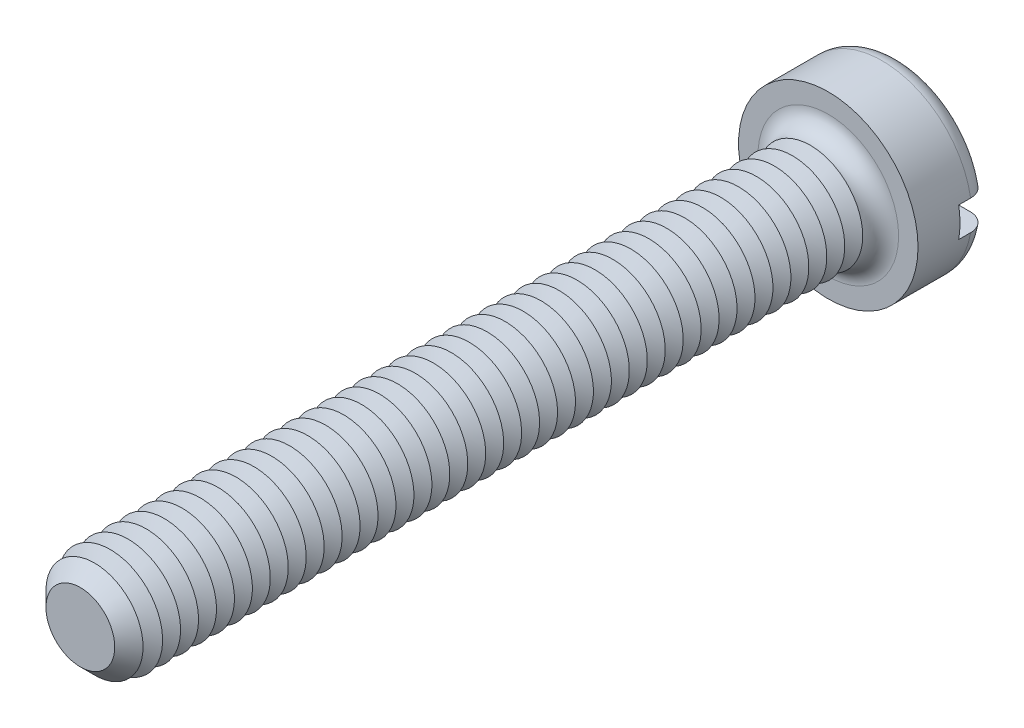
from build123d import *

# Parameters (mm, degrees)
SKETCH3_R           = 3
BOSS_EXTRUDE2_DEPTH = 2.4
SKETCH4_R           = 1.75
BOSS_EXTRUDE3_DEPTH = 25
FILLET1_R           = 0.6
CHAMFER1_SIZE       = 0.6
LPATTERN1_COUNT     = 40
LPATTERN1_PITCH     = 0.6
SKETCH8_W           = 6
SKETCH8_H           = 1
CUT_EXTRUDE1_DEPTH  = 1


with BuildPart() as part:
    # Sketch3 → Boss-Extrude2 (new body)
    with BuildSketch(Plane.XY):
        Circle(SKETCH3_R)
    extrude(amount=-BOSS_EXTRUDE2_DEPTH)

    # Sketch4 → Boss-Extrude3 (add)
    with BuildSketch(Plane.XY):
        Circle(SKETCH4_R)
    extrude(amount=BOSS_EXTRUDE3_DEPTH)

    # Fillet1
    fillet1_edges = [part.edges().sort_by_distance(p)[0] for p in [
        (-3, 0, -2.4),
        (-1.75, 0, 0),
    ]]
    fillet(fillet1_edges, radius=FILLET1_R)

    # Chamfer1
    chamfer1_edges = [part.edges().sort_by_distance(p)[0] for p in [
        (-1.75, 0, 25),
    ]]
    chamfer(chamfer1_edges, length=CHAMFER1_SIZE)

    # Sketch6 → Cut-Revolve1 (revolve, cut)
    with BuildSketch(Plane(origin=(0, 0, 0), x_dir=(0, 0, -1), z_dir=(1, 0, 0)), mode=Mode.PRIVATE) as cut_revolve1_sk:
        Polygon((-0.6, 1.75), (-0.9, 1.230384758), (-1.2, 1.75), align=None)
    cut_revolve1 = revolve(cut_revolve1_sk.sketch.rotate(Axis((0, 0, -1.694361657), (0, 0, 1)), 90), axis=Axis((0, 0, -1.694361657), (0, 0, 1)), mode=Mode.SUBTRACT)

    # LPattern1: Cut-Revolve1 ×40
    with Locations(*[(0, 0, i * LPATTERN1_PITCH) for i in range(1, LPATTERN1_COUNT)]):
        add(cut_revolve1, mode=Mode.SUBTRACT)

    # Sketch8 → Cut-Extrude1 (cut)
    with BuildSketch(Plane(origin=(0, 0, -2.4), x_dir=(-1, 0, 0), z_dir=(0, 0, -1))):
        Rectangle(SKETCH8_W, SKETCH8_H)
    extrude(amount=-CUT_EXTRUDE1_DEPTH, mode=Mode.SUBTRACT)


solid = part.part
